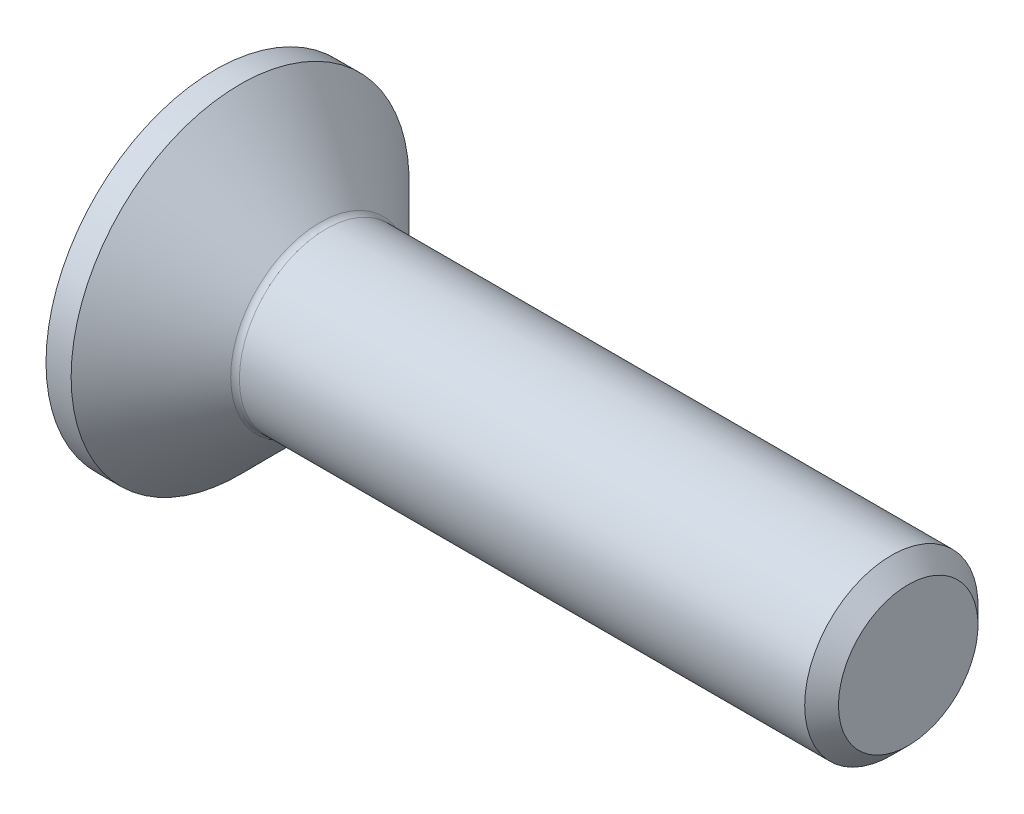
from build123d import *

# Parameters (mm, degrees)
FILLET1_R   = 0.2
HEX_2_DEPTH = 1.5


with BuildPart() as part:
    # BodySke → BaseBody (revolve)
    with BuildSketch(Plane.XY, mode=Mode.PRIVATE) as basebody_sk:
        Polygon((0, 0), (0, 3.9), (0.58, 3.9), (2.48, 2), (15.61, 2), (16, 1.61), (16, 0), align=None)
    revolve(basebody_sk.sketch.rotate(Axis((0, 0, 0), (1, 0, 0)), 90), axis=Axis((0, 0, 0), (1, 0, 0)))

    # Fillet1
    fillet1_edges = [part.edges().sort_by_distance(p)[0] for p in [
        (2.48, 0, -2),
    ]]
    fillet(fillet1_edges, radius=FILLET1_R)

    # Sketch2 → PreBroach (revolve, cut)
    with BuildSketch(Plane.XY, mode=Mode.PRIVATE) as prebroach_sk:
        Polygon((0, 1.25), (1.5, 1.25), (2.221687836, 0), (0, 0), align=None)
    revolve(prebroach_sk.sketch.rotate(Axis((0, 0, 0), (1, 0, 0)), 90), axis=Axis((0, 0, 0), (1, 0, 0)), mode=Mode.SUBTRACT)

    # Sketch3 → Hex 2 (cut)
    with BuildSketch(Plane.ZY):
        Polygon((-1.25, -0.721687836), (-1.25, 0.721687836), (0, 1.443375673), (1.25, 0.721687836), (1.25, -0.721687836), (0, -1.443375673), align=None)
    extrude(amount=-HEX_2_DEPTH, mode=Mode.SUBTRACT)


solid = part.part
